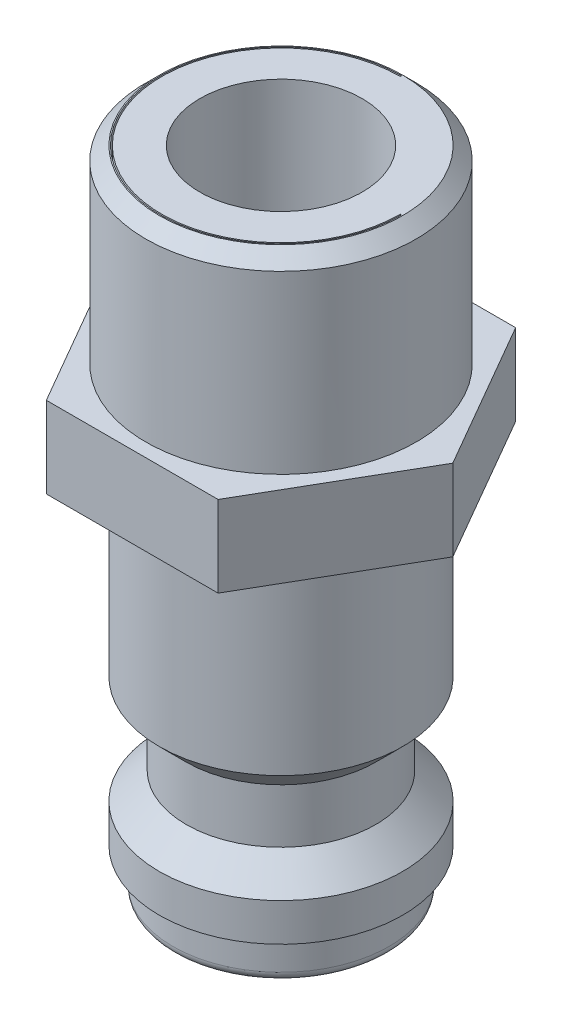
ISO-10303-21;
HEADER;
FILE_DESCRIPTION(('STEP AP214'),'2;1');
FILE_NAME('part.step','',(''),(''),'','','');
FILE_SCHEMA(('AUTOMOTIVE_DESIGN { 1 0 10303 214 1 1 1 1 }'));
ENDSEC;
DATA;
#1=APPLICATION_CONTEXT('core data for automotive mechanical design processes');
#2=APPLICATION_PROTOCOL_DEFINITION('international standard','automotive_design',2000,#1);
#3=PRODUCT_CONTEXT('',#1,'mechanical');
#4=PRODUCT('Part','Part','',(#3));
#5=PRODUCT_RELATED_PRODUCT_CATEGORY('part','',(#4));
#6=PRODUCT_DEFINITION_FORMATION('','',#4);
#7=PRODUCT_DEFINITION_CONTEXT('part definition',#1,'design');
#8=PRODUCT_DEFINITION('design','',#6,#7);
#9=PRODUCT_DEFINITION_SHAPE('','',#8);
#10=(LENGTH_UNIT() NAMED_UNIT(*) SI_UNIT(.MILLI.,.METRE.));
#11=(NAMED_UNIT(*) PLANE_ANGLE_UNIT() SI_UNIT($,.RADIAN.));
#12=(NAMED_UNIT(*) SI_UNIT($,.STERADIAN.) SOLID_ANGLE_UNIT());
#13=UNCERTAINTY_MEASURE_WITH_UNIT(LENGTH_MEASURE(1.E-05),#10,'distance_accuracy_value','');
#14=(GEOMETRIC_REPRESENTATION_CONTEXT(3) GLOBAL_UNCERTAINTY_ASSIGNED_CONTEXT((#13)) GLOBAL_UNIT_ASSIGNED_CONTEXT((#10,
#11,#12)) REPRESENTATION_CONTEXT('',''));
#15=CARTESIAN_POINT('',(0.,0.,0.));
#16=DIRECTION('',(0.,0.,1.));
#17=DIRECTION('',(1.,0.,0.));
#18=AXIS2_PLACEMENT_3D('',#15,#16,#17);
#19=CARTESIAN_POINT('',(0.,-9.99999999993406,0.));
#20=DIRECTION('',(0.,1.,0.));
#21=DIRECTION('',(0.,0.,1.));
#22=AXIS2_PLACEMENT_3D('',#19,#20,#21);
#23=CONICAL_SURFACE('',#22,4.50000000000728,0.78539816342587);
#24=CARTESIAN_POINT('',(0.,-10.,0.));
#25=DIRECTION('',(0.,1.,0.));
#26=DIRECTION('',(0.,0.,1.));
#27=AXIS2_PLACEMENT_3D('',#24,#25,#26);
#28=CIRCLE('',#27,4.5);
#29=CARTESIAN_POINT('',(0.,-10.,4.49999999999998));
#30=VERTEX_POINT('',#29);
#31=EDGE_CURVE('E333',#30,#30,#28,.T.);
#32=ORIENTED_EDGE('',*,*,#31,.F.);
#33=EDGE_LOOP('',(#32));
#34=FACE_BOUND('',#33,.T.);
#35=CARTESIAN_POINT('',(0.,-11.,0.));
#36=DIRECTION('',(0.,1.,0.));
#37=DIRECTION('',(0.,0.,1.));
#38=AXIS2_PLACEMENT_3D('',#35,#36,#37);
#39=CIRCLE('',#38,3.5);
#40=CARTESIAN_POINT('',(0.,-11.,3.49999999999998));
#41=VERTEX_POINT('',#40);
#42=EDGE_CURVE('E325',#41,#41,#39,.F.);
#43=ORIENTED_EDGE('',*,*,#42,.F.);
#44=EDGE_LOOP('',(#43));
#45=FACE_BOUND('',#44,.T.);
#46=ADVANCED_FACE('F40',(#34,#45),#23,.T.);
#47=CARTESIAN_POINT('',(0.,-6.75000000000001,0.));
#48=DIRECTION('',(0.,1.,0.));
#49=DIRECTION('',(0.,0.,1.));
#50=AXIS2_PLACEMENT_3D('',#47,#48,#49);
#51=CYLINDRICAL_SURFACE('',#50,4.5);
#52=CARTESIAN_POINT('',(0.,-3.5,0.));
#53=DIRECTION('',(0.,-1.,0.));
#54=DIRECTION('',(0.,0.,-1.));
#55=AXIS2_PLACEMENT_3D('',#52,#53,#54);
#56=CIRCLE('',#55,4.5);
#57=CARTESIAN_POINT('',(0.,-3.5,-4.50000000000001));
#58=VERTEX_POINT('',#57);
#59=EDGE_CURVE('E317',#58,#58,#56,.T.);
#60=ORIENTED_EDGE('',*,*,#59,.T.);
#61=EDGE_LOOP('',(#60));
#62=FACE_BOUND('',#61,.T.);
#63=ORIENTED_EDGE('',*,*,#31,.T.);
#64=EDGE_LOOP('',(#63));
#65=FACE_BOUND('',#64,.T.);
#66=ADVANCED_FACE('F394',(#62,#65),#51,.T.);
#67=CARTESIAN_POINT('',(0.,-12.,0.));
#68=DIRECTION('',(0.,1.,0.));
#69=DIRECTION('',(0.,0.,1.));
#70=AXIS2_PLACEMENT_3D('',#67,#68,#69);
#71=CYLINDRICAL_SURFACE('',#70,3.5);
#72=ORIENTED_EDGE('',*,*,#42,.T.);
#73=EDGE_LOOP('',(#72));
#74=FACE_BOUND('',#73,.T.);
#75=CARTESIAN_POINT('',(0.,-13.0000000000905,0.));
#76=DIRECTION('',(0.,-1.,0.));
#77=DIRECTION('',(-1.,0.,0.));
#78=AXIS2_PLACEMENT_3D('',#75,#76,#77);
#79=CIRCLE('',#78,3.49999999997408);
#80=CARTESIAN_POINT('',(-3.49999999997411,-13.0000000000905,0.));
#81=VERTEX_POINT('',#80);
#82=EDGE_CURVE('E312',#81,#81,#79,.T.);
#83=ORIENTED_EDGE('',*,*,#82,.F.);
#84=EDGE_LOOP('',(#83));
#85=FACE_BOUND('',#84,.T.);
#86=ADVANCED_FACE('F264',(#74,#85),#71,.T.);
#87=CARTESIAN_POINT('',(0.,-3.5,0.));
#88=DIRECTION('',(0.,-1.,0.));
#89=DIRECTION('',(0.,0.,-1.));
#90=AXIS2_PLACEMENT_3D('',#87,#88,#89);
#91=TOROIDAL_SURFACE('',#90,4.99999999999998,0.5);
#92=CARTESIAN_POINT('',(0.,-3.,0.));
#93=DIRECTION('',(0.,-1.,0.));
#94=DIRECTION('',(-1.,0.,0.));
#95=AXIS2_PLACEMENT_3D('',#92,#93,#94);
#96=CIRCLE('',#95,4.99999999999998);
#97=CARTESIAN_POINT('',(-5.00000000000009,-2.99999999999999,0.));
#98=VERTEX_POINT('',#97);
#99=CARTESIAN_POINT('',(0.,-3.,-4.99999999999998));
#100=VERTEX_POINT('',#99);
#101=EDGE_CURVE('E241',#98,#100,#96,.T.);
#102=ORIENTED_EDGE('',*,*,#101,.T.);
#103=CARTESIAN_POINT('',(0.,-3.,0.));
#104=DIRECTION('',(0.,-1.,0.));
#105=DIRECTION('',(0.,0.,-1.));
#106=AXIS2_PLACEMENT_3D('',#103,#104,#105);
#107=CIRCLE('',#106,4.99999999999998);
#108=CARTESIAN_POINT('',(0.,-2.99999999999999,5.00000000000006));
#109=VERTEX_POINT('',#108);
#110=EDGE_CURVE('E273',#100,#109,#107,.T.);
#111=ORIENTED_EDGE('',*,*,#110,.T.);
#112=CARTESIAN_POINT('',(0.,-3.,0.));
#113=DIRECTION('',(0.,-1.,0.));
#114=DIRECTION('',(0.,0.,1.));
#115=AXIS2_PLACEMENT_3D('',#112,#113,#114);
#116=CIRCLE('',#115,4.99999999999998);
#117=EDGE_CURVE('E304',#109,#98,#116,.T.);
#118=ORIENTED_EDGE('',*,*,#117,.T.);
#119=EDGE_LOOP('',(#102,#111,#118));
#120=FACE_BOUND('',#119,.T.);
#121=ORIENTED_EDGE('',*,*,#59,.F.);
#122=EDGE_LOOP('',(#121));
#123=FACE_BOUND('',#122,.T.);
#124=ADVANCED_FACE('F252',(#120,#123),#91,.F.);
#125=CARTESIAN_POINT('',(0.,-14.0000000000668,0.));
#126=DIRECTION('',(0.,-1.,0.));
#127=DIRECTION('',(0.,0.,-1.));
#128=AXIS2_PLACEMENT_3D('',#125,#126,#127);
#129=CONICAL_SURFACE('',#128,4.50000000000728,0.78539816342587);
#130=ORIENTED_EDGE('',*,*,#82,.T.);
#131=EDGE_LOOP('',(#130));
#132=FACE_BOUND('',#131,.T.);
#133=CARTESIAN_POINT('',(0.,-14.,0.));
#134=DIRECTION('',(0.,1.,0.));
#135=DIRECTION('',(0.,0.,1.));
#136=AXIS2_PLACEMENT_3D('',#133,#134,#135);
#137=CIRCLE('',#136,4.5);
#138=CARTESIAN_POINT('',(0.,-14.,4.49999999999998));
#139=VERTEX_POINT('',#138);
#140=EDGE_CURVE('E237',#139,#139,#137,.F.);
#141=ORIENTED_EDGE('',*,*,#140,.F.);
#142=EDGE_LOOP('',(#141));
#143=FACE_BOUND('',#142,.T.);
#144=ADVANCED_FACE('F263',(#132,#143),#129,.T.);
#145=CARTESIAN_POINT('',(0.,-3.,0.));
#146=DIRECTION('',(0.,1.,0.));
#147=DIRECTION('',(0.,0.,1.));
#148=AXIS2_PLACEMENT_3D('',#145,#146,#147);
#149=PLANE('',#148);
#150=ORIENTED_EDGE('',*,*,#117,.F.);
#151=ORIENTED_EDGE('',*,*,#110,.F.);
#152=ORIENTED_EDGE('',*,*,#101,.F.);
#153=EDGE_LOOP('',(#150,#151,#152));
#154=FACE_BOUND('',#153,.T.);
#155=DIRECTION('',(-1.,0.,0.));
#156=VECTOR('',#155,1.);
#157=CARTESIAN_POINT('',(-3.17542648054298,-3.,-5.49999999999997));
#158=LINE('',#157,#156);
#159=CARTESIAN_POINT('',(3.17542648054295,-3.,-5.5));
#160=VERTEX_POINT('',#159);
#161=CARTESIAN_POINT('',(-3.17542648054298,-3.,-5.49999999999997));
#162=VERTEX_POINT('',#161);
#163=EDGE_CURVE('E147',#160,#162,#158,.T.);
#164=ORIENTED_EDGE('',*,*,#163,.F.);
#165=DIRECTION('',(-0.5,0.,-0.866025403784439));
#166=VECTOR('',#165,1.);
#167=CARTESIAN_POINT('',(3.17542648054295,-3.,-5.5));
#168=LINE('',#167,#166);
#169=CARTESIAN_POINT('',(6.35085296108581,-3.,0.));
#170=VERTEX_POINT('',#169);
#171=EDGE_CURVE('E696',#170,#160,#168,.T.);
#172=ORIENTED_EDGE('',*,*,#171,.F.);
#173=DIRECTION('',(0.500000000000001,0.,-0.86602540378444));
#174=VECTOR('',#173,1.);
#175=CARTESIAN_POINT('',(6.35085296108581,-3.,0.));
#176=LINE('',#175,#174);
#177=CARTESIAN_POINT('',(3.17542648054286,-2.99999999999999,5.50000000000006));
#178=VERTEX_POINT('',#177);
#179=EDGE_CURVE('E689',#178,#170,#176,.T.);
#180=ORIENTED_EDGE('',*,*,#179,.F.);
#181=DIRECTION('',(1.,0.,0.));
#182=VECTOR('',#181,1.);
#183=CARTESIAN_POINT('',(3.17542648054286,-2.99999999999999,5.50000000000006));
#184=LINE('',#183,#182);
#185=CARTESIAN_POINT('',(-3.17542648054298,-2.99999999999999,5.50000000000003));
#186=VERTEX_POINT('',#185);
#187=EDGE_CURVE('E680',#186,#178,#184,.T.);
#188=ORIENTED_EDGE('',*,*,#187,.F.);
#189=DIRECTION('',(0.5,0.,0.866025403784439));
#190=VECTOR('',#189,1.);
#191=CARTESIAN_POINT('',(-3.17542648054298,-2.99999999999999,5.50000000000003));
#192=LINE('',#191,#190);
#193=CARTESIAN_POINT('',(-6.35085296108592,-2.99999999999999,0.));
#194=VERTEX_POINT('',#193);
#195=EDGE_CURVE('E686',#194,#186,#192,.T.);
#196=ORIENTED_EDGE('',*,*,#195,.F.);
#197=DIRECTION('',(-0.500000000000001,0.,0.86602540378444));
#198=VECTOR('',#197,1.);
#199=CARTESIAN_POINT('',(-6.35085296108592,-2.99999999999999,0.));
#200=LINE('',#199,#198);
#201=EDGE_CURVE('E152',#162,#194,#200,.T.);
#202=ORIENTED_EDGE('',*,*,#201,.F.);
#203=EDGE_LOOP('',(#164,#172,#180,#188,#196,#202));
#204=FACE_BOUND('',#203,.T.);
#205=ADVANCED_FACE('F278',(#154,#204),#149,.F.);
#206=CARTESIAN_POINT('',(0.,-14.7,0.));
#207=DIRECTION('',(0.,1.,0.));
#208=DIRECTION('',(0.,0.,1.));
#209=AXIS2_PLACEMENT_3D('',#206,#207,#208);
#210=CYLINDRICAL_SURFACE('',#209,4.5);
#211=ORIENTED_EDGE('',*,*,#140,.T.);
#212=EDGE_LOOP('',(#211));
#213=FACE_BOUND('',#212,.T.);
#214=CARTESIAN_POINT('',(0.,-15.3999999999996,0.));
#215=DIRECTION('',(0.,1.,0.));
#216=DIRECTION('',(-1.,0.,0.));
#217=AXIS2_PLACEMENT_3D('',#214,#215,#216);
#218=CIRCLE('',#217,4.50000000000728);
#219=CARTESIAN_POINT('',(-4.50000000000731,-15.3999999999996,0.));
#220=VERTEX_POINT('',#219);
#221=EDGE_CURVE('E229',#220,#220,#218,.F.);
#222=ORIENTED_EDGE('',*,*,#221,.F.);
#223=EDGE_LOOP('',(#222));
#224=FACE_BOUND('',#223,.T.);
#225=ADVANCED_FACE('F287',(#213,#224),#210,.T.);
#226=CARTESIAN_POINT('',(-3.17542648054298,-3.,-5.49999999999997));
#227=DIRECTION('',(0.,0.,-1.));
#228=DIRECTION('',(-1.,0.,0.));
#229=AXIS2_PLACEMENT_3D('',#226,#227,#228);
#230=PLANE('',#229);
#231=ORIENTED_EDGE('',*,*,#163,.T.);
#232=DIRECTION('',(0.,1.,0.));
#233=VECTOR('',#232,1.);
#234=CARTESIAN_POINT('',(-3.17542648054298,-3.,-5.49999999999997));
#235=LINE('',#234,#233);
#236=CARTESIAN_POINT('',(-3.17542648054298,0.,-5.49999999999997));
#237=VERTEX_POINT('',#236);
#238=EDGE_CURVE('E144',#237,#162,#235,.F.);
#239=ORIENTED_EDGE('',*,*,#238,.F.);
#240=DIRECTION('',(1.,0.,0.));
#241=VECTOR('',#240,1.);
#242=CARTESIAN_POINT('',(0.,0.,-5.49999999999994));
#243=LINE('',#242,#241);
#244=CARTESIAN_POINT('',(3.17542648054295,0.,-5.5));
#245=VERTEX_POINT('',#244);
#246=EDGE_CURVE('E129',#245,#237,#243,.F.);
#247=ORIENTED_EDGE('',*,*,#246,.F.);
#248=DIRECTION('',(0.,1.,0.));
#249=VECTOR('',#248,1.);
#250=CARTESIAN_POINT('',(3.17542648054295,-3.,-5.5));
#251=LINE('',#250,#249);
#252=EDGE_CURVE('E236',#160,#245,#251,.T.);
#253=ORIENTED_EDGE('',*,*,#252,.F.);
#254=EDGE_LOOP('',(#231,#239,#247,#253));
#255=FACE_BOUND('',#254,.T.);
#256=ADVANCED_FACE('F145',(#255),#230,.T.);
#257=CARTESIAN_POINT('',(-6.35085296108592,-2.99999999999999,0.));
#258=DIRECTION('',(-0.866025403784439,0.,-0.5));
#259=DIRECTION('',(-0.500000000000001,0.,0.86602540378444));
#260=AXIS2_PLACEMENT_3D('',#257,#258,#259);
#261=PLANE('',#260);
#262=ORIENTED_EDGE('',*,*,#201,.T.);
#263=DIRECTION('',(0.,1.,0.));
#264=VECTOR('',#263,1.);
#265=CARTESIAN_POINT('',(-6.35085296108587,-2.99999999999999,0.));
#266=LINE('',#265,#264);
#267=CARTESIAN_POINT('',(-6.35085296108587,0.,0.));
#268=VERTEX_POINT('',#267);
#269=EDGE_CURVE('E156',#268,#194,#266,.F.);
#270=ORIENTED_EDGE('',*,*,#269,.F.);
#271=DIRECTION('',(-0.500000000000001,0.,0.86602540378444));
#272=VECTOR('',#271,1.);
#273=CARTESIAN_POINT('',(-3.17542648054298,0.,-5.49999999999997));
#274=LINE('',#273,#272);
#275=EDGE_CURVE('E134',#237,#268,#274,.T.);
#276=ORIENTED_EDGE('',*,*,#275,.F.);
#277=ORIENTED_EDGE('',*,*,#238,.T.);
#278=EDGE_LOOP('',(#262,#270,#276,#277));
#279=FACE_BOUND('',#278,.T.);
#280=ADVANCED_FACE('F154',(#279),#261,.T.);
#281=CARTESIAN_POINT('',(-3.17542648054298,-2.99999999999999,5.50000000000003));
#282=DIRECTION('',(-0.86602540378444,0.,0.500000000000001));
#283=DIRECTION('',(0.5,0.,0.866025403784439));
#284=AXIS2_PLACEMENT_3D('',#281,#282,#283);
#285=PLANE('',#284);
#286=ORIENTED_EDGE('',*,*,#195,.T.);
#287=DIRECTION('',(0.,1.,0.));
#288=VECTOR('',#287,1.);
#289=CARTESIAN_POINT('',(-3.17542648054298,-2.99999999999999,5.50000000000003));
#290=LINE('',#289,#288);
#291=CARTESIAN_POINT('',(-3.17542648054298,0.,5.50000000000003));
#292=VERTEX_POINT('',#291);
#293=EDGE_CURVE('E683',#292,#186,#290,.F.);
#294=ORIENTED_EDGE('',*,*,#293,.F.);
#295=DIRECTION('',(0.5,0.,0.866025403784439));
#296=VECTOR('',#295,1.);
#297=CARTESIAN_POINT('',(-6.35085296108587,0.,0.));
#298=LINE('',#297,#296);
#299=EDGE_CURVE('E159',#268,#292,#298,.T.);
#300=ORIENTED_EDGE('',*,*,#299,.F.);
#301=ORIENTED_EDGE('',*,*,#269,.T.);
#302=EDGE_LOOP('',(#286,#294,#300,#301));
#303=FACE_BOUND('',#302,.T.);
#304=ADVANCED_FACE('F434',(#303),#285,.T.);
#305=CARTESIAN_POINT('',(3.17542648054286,-2.99999999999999,5.50000000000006));
#306=DIRECTION('',(0.,0.,1.));
#307=DIRECTION('',(1.,0.,0.));
#308=AXIS2_PLACEMENT_3D('',#305,#306,#307);
#309=PLANE('',#308);
#310=ORIENTED_EDGE('',*,*,#187,.T.);
#311=DIRECTION('',(0.,1.,0.));
#312=VECTOR('',#311,1.);
#313=CARTESIAN_POINT('',(3.17542648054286,-2.99999999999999,5.50000000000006));
#314=LINE('',#313,#312);
#315=CARTESIAN_POINT('',(3.17542648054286,0.,5.50000000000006));
#316=VERTEX_POINT('',#315);
#317=EDGE_CURVE('E682',#316,#178,#314,.F.);
#318=ORIENTED_EDGE('',*,*,#317,.F.);
#319=DIRECTION('',(1.,0.,0.));
#320=VECTOR('',#319,1.);
#321=CARTESIAN_POINT('',(0.,0.,5.50000000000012));
#322=LINE('',#321,#320);
#323=EDGE_CURVE('E163',#292,#316,#322,.T.);
#324=ORIENTED_EDGE('',*,*,#323,.F.);
#325=ORIENTED_EDGE('',*,*,#293,.T.);
#326=EDGE_LOOP('',(#310,#318,#324,#325));
#327=FACE_BOUND('',#326,.T.);
#328=ADVANCED_FACE('F440',(#327),#309,.T.);
#329=CARTESIAN_POINT('',(6.35085296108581,-3.,0.));
#330=DIRECTION('',(0.866025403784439,0.,0.5));
#331=DIRECTION('',(0.500000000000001,0.,-0.86602540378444));
#332=AXIS2_PLACEMENT_3D('',#329,#330,#331);
#333=PLANE('',#332);
#334=ORIENTED_EDGE('',*,*,#179,.T.);
#335=DIRECTION('',(0.,1.,0.));
#336=VECTOR('',#335,1.);
#337=CARTESIAN_POINT('',(6.35085296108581,-3.,0.));
#338=LINE('',#337,#336);
#339=CARTESIAN_POINT('',(6.35085296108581,0.,0.));
#340=VERTEX_POINT('',#339);
#341=EDGE_CURVE('E691',#340,#170,#338,.F.);
#342=ORIENTED_EDGE('',*,*,#341,.F.);
#343=DIRECTION('',(0.500000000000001,0.,-0.86602540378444));
#344=VECTOR('',#343,1.);
#345=CARTESIAN_POINT('',(3.17542648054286,0.,5.50000000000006));
#346=LINE('',#345,#344);
#347=EDGE_CURVE('E110',#316,#340,#346,.T.);
#348=ORIENTED_EDGE('',*,*,#347,.F.);
#349=ORIENTED_EDGE('',*,*,#317,.T.);
#350=EDGE_LOOP('',(#334,#342,#348,#349));
#351=FACE_BOUND('',#350,.T.);
#352=ADVANCED_FACE('F447',(#351),#333,.T.);
#353=CARTESIAN_POINT('',(3.17542648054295,-3.,-5.5));
#354=DIRECTION('',(0.86602540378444,0.,-0.500000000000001));
#355=DIRECTION('',(-0.5,0.,-0.866025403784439));
#356=AXIS2_PLACEMENT_3D('',#353,#354,#355);
#357=PLANE('',#356);
#358=ORIENTED_EDGE('',*,*,#171,.T.);
#359=ORIENTED_EDGE('',*,*,#252,.T.);
#360=DIRECTION('',(-0.5,0.,-0.866025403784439));
#361=VECTOR('',#360,1.);
#362=CARTESIAN_POINT('',(6.35085296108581,0.,0.));
#363=LINE('',#362,#361);
#364=EDGE_CURVE('E137',#340,#245,#363,.T.);
#365=ORIENTED_EDGE('',*,*,#364,.F.);
#366=ORIENTED_EDGE('',*,*,#341,.T.);
#367=EDGE_LOOP('',(#358,#359,#365,#366));
#368=FACE_BOUND('',#367,.T.);
#369=ADVANCED_FACE('F454',(#368),#357,.T.);
#370=CARTESIAN_POINT('',(0.,-15.4000000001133,0.));
#371=DIRECTION('',(0.,1.,0.));
#372=DIRECTION('',(0.,0.,1.));
#373=AXIS2_PLACEMENT_3D('',#370,#371,#372);
#374=CONICAL_SURFACE('',#373,4.49999999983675,1.04719755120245);
#375=ORIENTED_EDGE('',*,*,#221,.T.);
#376=EDGE_LOOP('',(#375));
#377=FACE_BOUND('',#376,.T.);
#378=CARTESIAN_POINT('',(0.,-15.6886751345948,0.));
#379=DIRECTION('',(0.,1.,0.));
#380=DIRECTION('',(0.,0.,1.));
#381=AXIS2_PLACEMENT_3D('',#378,#379,#380);
#382=CIRCLE('',#381,4.);
#383=CARTESIAN_POINT('',(0.,-15.6886751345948,3.99999999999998));
#384=VERTEX_POINT('',#383);
#385=EDGE_CURVE('E214',#384,#384,#382,.F.);
#386=ORIENTED_EDGE('',*,*,#385,.F.);
#387=EDGE_LOOP('',(#386));
#388=FACE_BOUND('',#387,.T.);
#389=ADVANCED_FACE('F461',(#377,#388),#374,.T.);
#390=CARTESIAN_POINT('',(4.43499999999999,3.5,0.));
#391=DIRECTION('',(0.,0.,1.));
#392=DIRECTION('',(1.,0.,0.));
#393=AXIS2_PLACEMENT_3D('',#390,#391,#392);
#394=PLANE('',#393);
#395=DIRECTION('',(0.,-1.,0.));
#396=VECTOR('',#395,1.);
#397=CARTESIAN_POINT('',(4.41000000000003,3.5,1.07552855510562E-13));
#398=LINE('',#397,#396);
#399=CARTESIAN_POINT('',(4.41,0.,0.));
#400=VERTEX_POINT('',#399);
#401=CARTESIAN_POINT('',(4.41000000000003,6.99999999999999,1.07552855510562E-13));
#402=VERTEX_POINT('',#401);
#403=EDGE_CURVE('E207',#400,#402,#398,.F.);
#404=ORIENTED_EDGE('',*,*,#403,.F.);
#405=DIRECTION('',(1.,0.,0.));
#406=VECTOR('',#405,1.);
#407=CARTESIAN_POINT('',(0.,0.,0.));
#408=LINE('',#407,#406);
#409=CARTESIAN_POINT('',(4.45999999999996,0.,0.));
#410=VERTEX_POINT('',#409);
#411=EDGE_CURVE('E98',#410,#400,#408,.F.);
#412=ORIENTED_EDGE('',*,*,#411,.F.);
#413=DIRECTION('',(0.,-1.,0.));
#414=VECTOR('',#413,1.);
#415=CARTESIAN_POINT('',(4.45999999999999,3.5,1.14491749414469E-13));
#416=LINE('',#415,#414);
#417=CARTESIAN_POINT('',(4.45999999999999,6.99999999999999,1.14491749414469E-13));
#418=VERTEX_POINT('',#417);
#419=EDGE_CURVE('E203',#410,#418,#416,.F.);
#420=ORIENTED_EDGE('',*,*,#419,.T.);
#421=DIRECTION('',(1.,0.,0.));
#422=VECTOR('',#421,1.);
#423=CARTESIAN_POINT('',(4.43499999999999,6.99999999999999,0.));
#424=LINE('',#423,#422);
#425=EDGE_CURVE('E226',#418,#402,#424,.F.);
#426=ORIENTED_EDGE('',*,*,#425,.T.);
#427=EDGE_LOOP('',(#404,#412,#420,#426));
#428=FACE_BOUND('',#427,.T.);
#429=ADVANCED_FACE('F468',(#428),#394,.T.);
#430=CARTESIAN_POINT('',(0.,3.49999999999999,-4.43499999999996));
#431=DIRECTION('',(1.,0.,0.));
#432=DIRECTION('',(0.,0.,-1.));
#433=AXIS2_PLACEMENT_3D('',#430,#431,#432);
#434=PLANE('',#433);
#435=DIRECTION('',(0.,-1.,0.));
#436=VECTOR('',#435,1.);
#437=CARTESIAN_POINT('',(0.,3.5,-4.40999999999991));
#438=LINE('',#437,#436);
#439=CARTESIAN_POINT('',(0.,6.99999999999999,-4.40999999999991));
#440=VERTEX_POINT('',#439);
#441=CARTESIAN_POINT('',(0.,0.,-4.40999999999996));
#442=VERTEX_POINT('',#441);
#443=EDGE_CURVE('E211',#440,#442,#438,.T.);
#444=ORIENTED_EDGE('',*,*,#443,.F.);
#445=DIRECTION('',(0.,0.,-1.));
#446=VECTOR('',#445,1.);
#447=CARTESIAN_POINT('',(0.,6.99999999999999,-4.43499999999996));
#448=LINE('',#447,#446);
#449=CARTESIAN_POINT('',(0.,6.99999999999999,-4.45999999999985));
#450=VERTEX_POINT('',#449);
#451=EDGE_CURVE('E221',#450,#440,#448,.F.);
#452=ORIENTED_EDGE('',*,*,#451,.F.);
#453=DIRECTION('',(0.,-1.,0.));
#454=VECTOR('',#453,1.);
#455=CARTESIAN_POINT('',(0.,3.5,-4.4599999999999));
#456=LINE('',#455,#454);
#457=CARTESIAN_POINT('',(-1.11022302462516E-13,0.,-4.45999999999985));
#458=VERTEX_POINT('',#457);
#459=EDGE_CURVE('E193',#450,#458,#456,.T.);
#460=ORIENTED_EDGE('',*,*,#459,.T.);
#461=DIRECTION('',(0.,0.,1.));
#462=VECTOR('',#461,1.);
#463=CARTESIAN_POINT('',(0.,0.,0.));
#464=LINE('',#463,#462);
#465=EDGE_CURVE('E225',#442,#458,#464,.F.);
#466=ORIENTED_EDGE('',*,*,#465,.F.);
#467=EDGE_LOOP('',(#444,#452,#460,#466));
#468=FACE_BOUND('',#467,.T.);
#469=ADVANCED_FACE('F475',(#468),#434,.F.);
#470=CARTESIAN_POINT('',(0.,0.,0.));
#471=DIRECTION('',(0.,1.,0.));
#472=DIRECTION('',(0.,0.,1.));
#473=AXIS2_PLACEMENT_3D('',#470,#471,#472);
#474=PLANE('',#473);
#475=CARTESIAN_POINT('',(0.,0.,0.));
#476=DIRECTION('',(0.,-1.,0.));
#477=DIRECTION('',(0.,0.,-1.));
#478=AXIS2_PLACEMENT_3D('',#475,#476,#477);
#479=CIRCLE('',#478,4.46);
#480=EDGE_CURVE('E202',#458,#410,#479,.F.);
#481=ORIENTED_EDGE('',*,*,#480,.T.);
#482=ORIENTED_EDGE('',*,*,#411,.T.);
#483=CARTESIAN_POINT('',(0.,0.,0.));
#484=DIRECTION('',(0.,-1.,0.));
#485=DIRECTION('',(0.,0.,-1.));
#486=AXIS2_PLACEMENT_3D('',#483,#484,#485);
#487=CIRCLE('',#486,4.41);
#488=EDGE_CURVE('E101',#442,#400,#487,.F.);
#489=ORIENTED_EDGE('',*,*,#488,.F.);
#490=ORIENTED_EDGE('',*,*,#465,.T.);
#491=EDGE_LOOP('',(#481,#482,#489,#490));
#492=FACE_BOUND('',#491,.T.);
#493=ADVANCED_FACE('F482',(#492),#474,.T.);
#494=CARTESIAN_POINT('',(0.,0.,0.));
#495=DIRECTION('',(0.,1.,0.));
#496=DIRECTION('',(0.,0.,1.));
#497=AXIS2_PLACEMENT_3D('',#494,#495,#496);
#498=PLANE('',#497);
#499=ORIENTED_EDGE('',*,*,#347,.T.);
#500=ORIENTED_EDGE('',*,*,#364,.T.);
#501=ORIENTED_EDGE('',*,*,#246,.T.);
#502=ORIENTED_EDGE('',*,*,#275,.T.);
#503=ORIENTED_EDGE('',*,*,#299,.T.);
#504=ORIENTED_EDGE('',*,*,#323,.T.);
#505=EDGE_LOOP('',(#499,#500,#501,#502,#503,#504));
#506=FACE_BOUND('',#505,.T.);
#507=CARTESIAN_POINT('',(0.,0.,0.));
#508=DIRECTION('',(0.,-1.,0.));
#509=DIRECTION('',(0.,0.,-1.));
#510=AXIS2_PLACEMENT_3D('',#507,#508,#509);
#511=CIRCLE('',#510,5.);
#512=CARTESIAN_POINT('',(0.,0.,-5.00000000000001));
#513=VERTEX_POINT('',#512);
#514=EDGE_CURVE('E220',#513,#513,#511,.F.);
#515=ORIENTED_EDGE('',*,*,#514,.F.);
#516=EDGE_LOOP('',(#515));
#517=FACE_BOUND('',#516,.T.);
#518=ADVANCED_FACE('F131',(#506,#517),#498,.T.);
#519=CARTESIAN_POINT('',(0.,-16.1693375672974,0.));
#520=DIRECTION('',(0.,1.,0.));
#521=DIRECTION('',(0.,0.,1.));
#522=AXIS2_PLACEMENT_3D('',#519,#520,#521);
#523=CYLINDRICAL_SURFACE('',#522,4.);
#524=ORIENTED_EDGE('',*,*,#385,.T.);
#525=EDGE_LOOP('',(#524));
#526=FACE_BOUND('',#525,.T.);
#527=CARTESIAN_POINT('',(0.,-16.65,0.));
#528=DIRECTION('',(0.,-1.,0.));
#529=DIRECTION('',(0.,0.,-1.));
#530=AXIS2_PLACEMENT_3D('',#527,#528,#529);
#531=CIRCLE('',#530,4.);
#532=CARTESIAN_POINT('',(0.,-16.65,-4.00000000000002));
#533=VERTEX_POINT('',#532);
#534=EDGE_CURVE('E215',#533,#533,#531,.T.);
#535=ORIENTED_EDGE('',*,*,#534,.F.);
#536=EDGE_LOOP('',(#535));
#537=FACE_BOUND('',#536,.T.);
#538=ADVANCED_FACE('F494',(#526,#537),#523,.T.);
#539=CARTESIAN_POINT('',(0.,3.5,0.));
#540=DIRECTION('',(0.,-1.,0.));
#541=DIRECTION('',(0.,0.,-1.));
#542=AXIS2_PLACEMENT_3D('',#539,#540,#541);
#543=CYLINDRICAL_SURFACE('',#542,4.41);
#544=ORIENTED_EDGE('',*,*,#403,.T.);
#545=CARTESIAN_POINT('',(0.,6.99999999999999,0.));
#546=DIRECTION('',(0.,-1.,0.));
#547=DIRECTION('',(0.,0.,-1.));
#548=AXIS2_PLACEMENT_3D('',#545,#546,#547);
#549=CIRCLE('',#548,4.41);
#550=EDGE_CURVE('E219',#440,#402,#549,.F.);
#551=ORIENTED_EDGE('',*,*,#550,.F.);
#552=ORIENTED_EDGE('',*,*,#443,.T.);
#553=ORIENTED_EDGE('',*,*,#488,.T.);
#554=EDGE_LOOP('',(#544,#551,#552,#553));
#555=FACE_BOUND('',#554,.T.);
#556=ADVANCED_FACE('F500',(#555),#543,.T.);
#557=CARTESIAN_POINT('',(0.,3.5,0.));
#558=DIRECTION('',(0.,-1.,0.));
#559=DIRECTION('',(0.,0.,-1.));
#560=AXIS2_PLACEMENT_3D('',#557,#558,#559);
#561=CYLINDRICAL_SURFACE('',#560,4.46);
#562=ORIENTED_EDGE('',*,*,#480,.F.);
#563=ORIENTED_EDGE('',*,*,#459,.F.);
#564=CARTESIAN_POINT('',(0.,6.99999999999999,0.));
#565=DIRECTION('',(0.,-1.,0.));
#566=DIRECTION('',(0.,0.,-1.));
#567=AXIS2_PLACEMENT_3D('',#564,#565,#566);
#568=CIRCLE('',#567,4.46);
#569=EDGE_CURVE('E345',#418,#450,#568,.T.);
#570=ORIENTED_EDGE('',*,*,#569,.F.);
#571=ORIENTED_EDGE('',*,*,#419,.F.);
#572=EDGE_LOOP('',(#562,#563,#570,#571));
#573=FACE_BOUND('',#572,.T.);
#574=ADVANCED_FACE('F507',(#573),#561,.F.);
#575=CARTESIAN_POINT('',(0.,3.5,0.));
#576=DIRECTION('',(0.,-1.,0.));
#577=DIRECTION('',(0.,0.,-1.));
#578=AXIS2_PLACEMENT_3D('',#575,#576,#577);
#579=CYLINDRICAL_SURFACE('',#578,5.);
#580=CARTESIAN_POINT('',(0.,6.49999999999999,0.));
#581=DIRECTION('',(0.,1.,0.));
#582=DIRECTION('',(0.,0.,1.));
#583=AXIS2_PLACEMENT_3D('',#580,#581,#582);
#584=CIRCLE('',#583,5.);
#585=CARTESIAN_POINT('',(0.,6.49999999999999,5.00000000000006));
#586=VERTEX_POINT('',#585);
#587=EDGE_CURVE('E11',#586,#586,#584,.F.);
#588=ORIENTED_EDGE('',*,*,#587,.T.);
#589=EDGE_LOOP('',(#588));
#590=FACE_BOUND('',#589,.T.);
#591=ORIENTED_EDGE('',*,*,#514,.T.);
#592=EDGE_LOOP('',(#591));
#593=FACE_BOUND('',#592,.T.);
#594=ADVANCED_FACE('F177',(#590,#593),#579,.T.);
#595=CARTESIAN_POINT('',(0.,-16.65,0.));
#596=DIRECTION('',(0.,-1.,0.));
#597=DIRECTION('',(0.,0.,-1.));
#598=AXIS2_PLACEMENT_3D('',#595,#596,#597);
#599=TOROIDAL_SURFACE('',#598,3.64999999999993,0.35);
#600=CARTESIAN_POINT('',(0.,-17.,0.));
#601=DIRECTION('',(0.,1.,0.));
#602=DIRECTION('',(0.,0.,1.));
#603=AXIS2_PLACEMENT_3D('',#600,#601,#602);
#604=CIRCLE('',#603,3.64999999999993);
#605=CARTESIAN_POINT('',(0.,-17.,-3.64999999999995));
#606=VERTEX_POINT('',#605);
#607=CARTESIAN_POINT('',(0.,-17.,3.65000000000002));
#608=VERTEX_POINT('',#607);
#609=EDGE_CURVE('E58',#606,#608,#604,.F.);
#610=ORIENTED_EDGE('',*,*,#609,.F.);
#611=CARTESIAN_POINT('',(0.,-17.,0.));
#612=DIRECTION('',(0.,1.,0.));
#613=DIRECTION('',(0.,0.,-1.));
#614=AXIS2_PLACEMENT_3D('',#611,#612,#613);
#615=CIRCLE('',#614,3.64999999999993);
#616=CARTESIAN_POINT('',(-3.65000000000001,-17.,0.));
#617=VERTEX_POINT('',#616);
#618=EDGE_CURVE('E349',#617,#606,#615,.F.);
#619=ORIENTED_EDGE('',*,*,#618,.F.);
#620=CARTESIAN_POINT('',(0.,-17.,0.));
#621=DIRECTION('',(0.,1.,0.));
#622=DIRECTION('',(-1.,0.,0.));
#623=AXIS2_PLACEMENT_3D('',#620,#621,#622);
#624=CIRCLE('',#623,3.64999999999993);
#625=EDGE_CURVE('E344',#608,#617,#624,.F.);
#626=ORIENTED_EDGE('',*,*,#625,.F.);
#627=EDGE_LOOP('',(#610,#619,#626));
#628=FACE_BOUND('',#627,.T.);
#629=ORIENTED_EDGE('',*,*,#534,.T.);
#630=EDGE_LOOP('',(#629));
#631=FACE_BOUND('',#630,.T.);
#632=ADVANCED_FACE('F171',(#628,#631),#599,.T.);
#633=CARTESIAN_POINT('',(0.,6.99999999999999,0.));
#634=DIRECTION('',(0.,1.,0.));
#635=DIRECTION('',(0.,0.,1.));
#636=AXIS2_PLACEMENT_3D('',#633,#634,#635);
#637=PLANE('',#636);
#638=CARTESIAN_POINT('',(0.,6.99999999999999,0.));
#639=DIRECTION('',(0.,1.,0.));
#640=DIRECTION('',(0.,0.,1.));
#641=AXIS2_PLACEMENT_3D('',#638,#639,#640);
#642=CIRCLE('',#641,4.5);
#643=CARTESIAN_POINT('',(0.,6.99999999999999,4.50000000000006));
#644=VERTEX_POINT('',#643);
#645=EDGE_CURVE('E50',#644,#644,#642,.T.);
#646=ORIENTED_EDGE('',*,*,#645,.T.);
#647=EDGE_LOOP('',(#646));
#648=FACE_BOUND('',#647,.T.);
#649=ORIENTED_EDGE('',*,*,#569,.T.);
#650=ORIENTED_EDGE('',*,*,#451,.T.);
#651=ORIENTED_EDGE('',*,*,#550,.T.);
#652=ORIENTED_EDGE('',*,*,#425,.F.);
#653=EDGE_LOOP('',(#649,#650,#651,#652));
#654=FACE_BOUND('',#653,.T.);
#655=CARTESIAN_POINT('',(0.,6.99999999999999,0.));
#656=DIRECTION('',(0.,-1.,0.));
#657=DIRECTION('',(0.,0.,-1.));
#658=AXIS2_PLACEMENT_3D('',#655,#656,#657);
#659=CIRCLE('',#658,3.);
#660=CARTESIAN_POINT('',(0.,6.99999999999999,-2.99999999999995));
#661=VERTEX_POINT('',#660);
#662=EDGE_CURVE('E341',#661,#661,#659,.T.);
#663=ORIENTED_EDGE('',*,*,#662,.T.);
#664=EDGE_LOOP('',(#663));
#665=FACE_BOUND('',#664,.T.);
#666=ADVANCED_FACE('F176',(#648,#654,#665),#637,.T.);
#667=CARTESIAN_POINT('',(-1.82500000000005,-17.,0.));
#668=DIRECTION('',(0.,-1.,0.));
#669=DIRECTION('',(0.,0.,-1.));
#670=AXIS2_PLACEMENT_3D('',#667,#668,#669);
#671=PLANE('',#670);
#672=ORIENTED_EDGE('',*,*,#609,.T.);
#673=ORIENTED_EDGE('',*,*,#625,.T.);
#674=ORIENTED_EDGE('',*,*,#618,.T.);
#675=EDGE_LOOP('',(#672,#673,#674));
#676=FACE_BOUND('',#675,.T.);
#677=CARTESIAN_POINT('',(0.,-17.,0.));
#678=DIRECTION('',(0.,-1.,0.));
#679=DIRECTION('',(0.,0.,-1.));
#680=AXIS2_PLACEMENT_3D('',#677,#678,#679);
#681=CIRCLE('',#680,3.);
#682=CARTESIAN_POINT('',(0.,-17.,-3.00000000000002));
#683=VERTEX_POINT('',#682);
#684=EDGE_CURVE('E337',#683,#683,#681,.F.);
#685=ORIENTED_EDGE('',*,*,#684,.T.);
#686=EDGE_LOOP('',(#685));
#687=FACE_BOUND('',#686,.T.);
#688=ADVANCED_FACE('F389',(#676,#687),#671,.T.);
#689=CARTESIAN_POINT('',(0.,-5.,0.));
#690=DIRECTION('',(0.,-1.,0.));
#691=DIRECTION('',(0.,0.,-1.));
#692=AXIS2_PLACEMENT_3D('',#689,#690,#691);
#693=CYLINDRICAL_SURFACE('',#692,3.);
#694=ORIENTED_EDGE('',*,*,#684,.F.);
#695=EDGE_LOOP('',(#694));
#696=FACE_BOUND('',#695,.T.);
#697=ORIENTED_EDGE('',*,*,#662,.F.);
#698=EDGE_LOOP('',(#697));
#699=FACE_BOUND('',#698,.T.);
#700=ADVANCED_FACE('F42',(#696,#699),#693,.F.);
#701=CARTESIAN_POINT('',(0.,6.99999999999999,0.));
#702=DIRECTION('',(0.,-1.,0.));
#703=DIRECTION('',(0.,0.,-1.));
#704=AXIS2_PLACEMENT_3D('',#701,#702,#703);
#705=CONICAL_SURFACE('',#704,4.5,0.785398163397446);
#706=ORIENTED_EDGE('',*,*,#587,.F.);
#707=EDGE_LOOP('',(#706));
#708=FACE_BOUND('',#707,.T.);
#709=ORIENTED_EDGE('',*,*,#645,.F.);
#710=EDGE_LOOP('',(#709));
#711=FACE_BOUND('',#710,.T.);
#712=ADVANCED_FACE('F382',(#708,#711),#705,.T.);
#713=CLOSED_SHELL('',(#46,#66,#86,#124,#144,#205,#225,#256,#280,#304,#328,#352,#369,#389,#429,
#469,#493,#518,#538,#556,#574,#594,#632,#666,#688,#700,#712));
#714=MANIFOLD_SOLID_BREP('B2',#713);
#715=ADVANCED_BREP_SHAPE_REPRESENTATION('',(#18,#714),#14);
#716=SHAPE_DEFINITION_REPRESENTATION(#9,#715);
ENDSEC;
END-ISO-10303-21;
